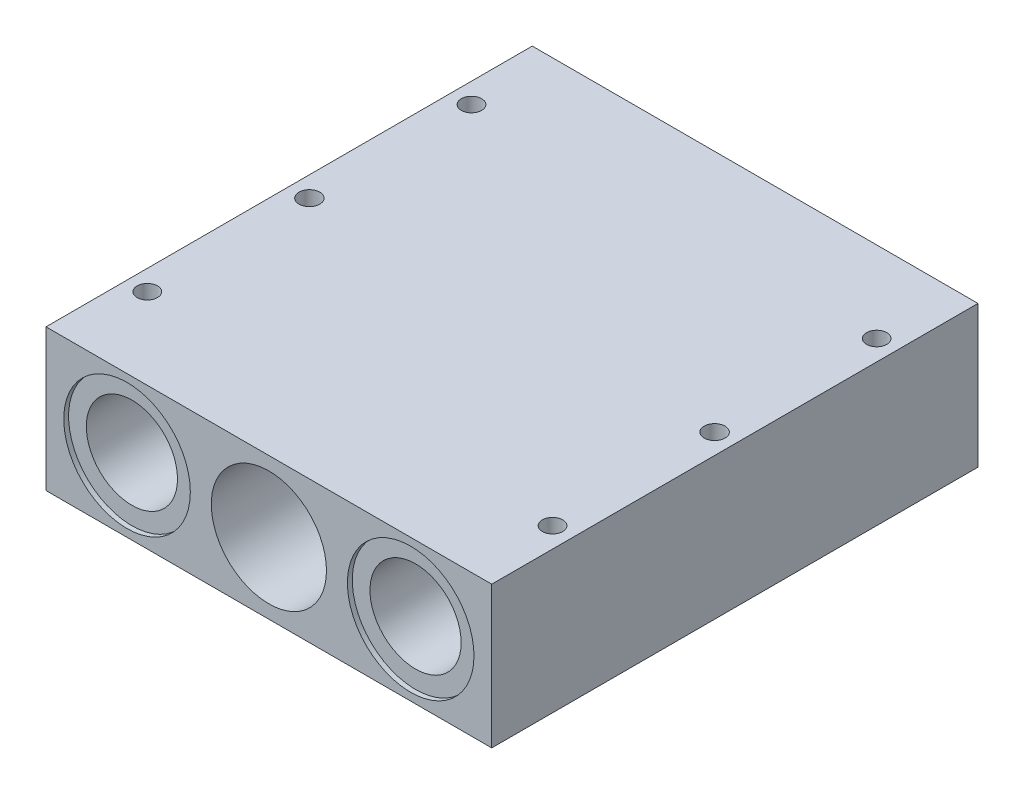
ISO-10303-21;
HEADER;
FILE_DESCRIPTION(('STEP AP214'),'2;1');
FILE_NAME('part.step','',(''),(''),'','','');
FILE_SCHEMA(('AUTOMOTIVE_DESIGN { 1 0 10303 214 1 1 1 1 }'));
ENDSEC;
DATA;
#1=APPLICATION_CONTEXT('core data for automotive mechanical design processes');
#2=APPLICATION_PROTOCOL_DEFINITION('international standard','automotive_design',2000,#1);
#3=PRODUCT_CONTEXT('',#1,'mechanical');
#4=PRODUCT('Part','Part','',(#3));
#5=PRODUCT_RELATED_PRODUCT_CATEGORY('part','',(#4));
#6=PRODUCT_DEFINITION_FORMATION('','',#4);
#7=PRODUCT_DEFINITION_CONTEXT('part definition',#1,'design');
#8=PRODUCT_DEFINITION('design','',#6,#7);
#9=PRODUCT_DEFINITION_SHAPE('','',#8);
#10=(LENGTH_UNIT() NAMED_UNIT(*) SI_UNIT(.MILLI.,.METRE.));
#11=(NAMED_UNIT(*) PLANE_ANGLE_UNIT() SI_UNIT($,.RADIAN.));
#12=(NAMED_UNIT(*) SI_UNIT($,.STERADIAN.) SOLID_ANGLE_UNIT());
#13=UNCERTAINTY_MEASURE_WITH_UNIT(LENGTH_MEASURE(1.E-05),#10,'distance_accuracy_value','');
#14=(GEOMETRIC_REPRESENTATION_CONTEXT(3) GLOBAL_UNCERTAINTY_ASSIGNED_CONTEXT((#13)) GLOBAL_UNIT_ASSIGNED_CONTEXT((#10,
#11,#12)) REPRESENTATION_CONTEXT('',''));
#15=CARTESIAN_POINT('',(0.,0.,0.));
#16=DIRECTION('',(0.,0.,1.));
#17=DIRECTION('',(1.,0.,0.));
#18=AXIS2_PLACEMENT_3D('',#15,#16,#17);
#19=CARTESIAN_POINT('',(44.45,0.,-76.2));
#20=DIRECTION('',(0.,0.,1.));
#21=DIRECTION('',(1.,0.,0.));
#22=AXIS2_PLACEMENT_3D('',#19,#20,#21);
#23=CYLINDRICAL_SURFACE('',#22,14.2875);
#24=CARTESIAN_POINT('',(44.45,0.,74.676));
#25=DIRECTION('',(0.,0.,1.));
#26=DIRECTION('',(1.,0.,0.));
#27=AXIS2_PLACEMENT_3D('',#24,#25,#26);
#28=CIRCLE('',#27,14.2875);
#29=CARTESIAN_POINT('',(58.7375,0.,74.676));
#30=VERTEX_POINT('',#29);
#31=EDGE_CURVE('E105',#30,#30,#28,.F.);
#32=CARTESIAN_POINT('',(44.45,0.,-74.676));
#33=DIRECTION('',(0.,0.,-1.));
#34=DIRECTION('',(-1.,0.,0.));
#35=AXIS2_PLACEMENT_3D('',#32,#33,#34);
#36=CIRCLE('',#35,14.2875);
#37=CARTESIAN_POINT('',(58.7375,0.,-74.676));
#38=VERTEX_POINT('',#37);
#39=EDGE_CURVE('E39',#38,#38,#36,.F.);
#40=CARTESIAN_POINT('',(58.7375,0.,74.676));
#41=CARTESIAN_POINT('',(58.7375,0.,73.12025));
#42=CARTESIAN_POINT('',(58.7375,0.,71.5645));
#43=CARTESIAN_POINT('',(58.7375,0.,68.453));
#44=CARTESIAN_POINT('',(58.7375,0.,66.89725));
#45=CARTESIAN_POINT('',(58.7375,0.,63.78575));
#46=CARTESIAN_POINT('',(58.7375,0.,62.23));
#47=CARTESIAN_POINT('',(58.7375,0.,59.1185));
#48=CARTESIAN_POINT('',(58.7375,0.,57.56275));
#49=CARTESIAN_POINT('',(58.7375,0.,54.45125));
#50=CARTESIAN_POINT('',(58.7375,0.,52.8955));
#51=CARTESIAN_POINT('',(58.7375,0.,49.784));
#52=CARTESIAN_POINT('',(58.7375,0.,48.22825));
#53=CARTESIAN_POINT('',(58.7375,0.,45.11675));
#54=CARTESIAN_POINT('',(58.7375,0.,43.561));
#55=CARTESIAN_POINT('',(58.7375,0.,40.4495));
#56=CARTESIAN_POINT('',(58.7375,0.,38.89375));
#57=CARTESIAN_POINT('',(58.7375,0.,35.78225));
#58=CARTESIAN_POINT('',(58.7375,0.,34.2265));
#59=CARTESIAN_POINT('',(58.7375,0.,31.115));
#60=CARTESIAN_POINT('',(58.7375,0.,29.55925));
#61=CARTESIAN_POINT('',(58.7375,0.,26.44775));
#62=CARTESIAN_POINT('',(58.7375,0.,24.892));
#63=CARTESIAN_POINT('',(58.7375,0.,21.7805));
#64=CARTESIAN_POINT('',(58.7375,0.,20.22475));
#65=CARTESIAN_POINT('',(58.7375,0.,17.11325));
#66=CARTESIAN_POINT('',(58.7375,0.,15.5575));
#67=CARTESIAN_POINT('',(58.7375,0.,12.446));
#68=CARTESIAN_POINT('',(58.7375,0.,10.89025));
#69=CARTESIAN_POINT('',(58.7375,0.,7.77874999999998));
#70=CARTESIAN_POINT('',(58.7375,0.,6.22299999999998));
#71=CARTESIAN_POINT('',(58.7375,0.,3.11149999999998));
#72=CARTESIAN_POINT('',(58.7375,0.,1.55574999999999));
#73=CARTESIAN_POINT('',(58.7375,0.,-1.55575000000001));
#74=CARTESIAN_POINT('',(58.7375,0.,-3.11150000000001));
#75=CARTESIAN_POINT('',(58.7375,0.,-6.22300000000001));
#76=CARTESIAN_POINT('',(58.7375,0.,-7.77875000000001));
#77=CARTESIAN_POINT('',(58.7375,0.,-10.89025));
#78=CARTESIAN_POINT('',(58.7375,0.,-12.446));
#79=CARTESIAN_POINT('',(58.7375,0.,-15.5575));
#80=CARTESIAN_POINT('',(58.7375,0.,-17.11325));
#81=CARTESIAN_POINT('',(58.7375,0.,-20.22475));
#82=CARTESIAN_POINT('',(58.7375,0.,-21.7805));
#83=CARTESIAN_POINT('',(58.7375,0.,-24.892));
#84=CARTESIAN_POINT('',(58.7375,0.,-26.44775));
#85=CARTESIAN_POINT('',(58.7375,0.,-29.55925));
#86=CARTESIAN_POINT('',(58.7375,0.,-31.115));
#87=CARTESIAN_POINT('',(58.7375,0.,-34.2265));
#88=CARTESIAN_POINT('',(58.7375,0.,-35.78225));
#89=CARTESIAN_POINT('',(58.7375,0.,-38.89375));
#90=CARTESIAN_POINT('',(58.7375,0.,-40.4495));
#91=CARTESIAN_POINT('',(58.7375,0.,-43.561));
#92=CARTESIAN_POINT('',(58.7375,0.,-45.11675));
#93=CARTESIAN_POINT('',(58.7375,0.,-48.22825));
#94=CARTESIAN_POINT('',(58.7375,0.,-49.784));
#95=CARTESIAN_POINT('',(58.7375,0.,-52.8955));
#96=CARTESIAN_POINT('',(58.7375,0.,-54.45125));
#97=CARTESIAN_POINT('',(58.7375,0.,-57.56275));
#98=CARTESIAN_POINT('',(58.7375,0.,-59.1185));
#99=CARTESIAN_POINT('',(58.7375,0.,-62.23));
#100=CARTESIAN_POINT('',(58.7375,0.,-63.78575));
#101=CARTESIAN_POINT('',(58.7375,0.,-66.89725));
#102=CARTESIAN_POINT('',(58.7375,0.,-68.453));
#103=CARTESIAN_POINT('',(58.7375,0.,-71.5645));
#104=CARTESIAN_POINT('',(58.7375,0.,-73.12025));
#105=CARTESIAN_POINT('',(58.7375,0.,-74.676));
#106=B_SPLINE_CURVE_WITH_KNOTS('',3,(#40,#41,#42,#43,#44,#45,#46,#47,#48,#49,#50,#51,#52,#53,
#54,#55,#56,#57,#58,#59,#60,#61,#62,#63,#64,#65,#66,#67,#68,#69,#70,#71,#72,#73,#74,#75,#76,#77,
#78,#79,#80,#81,#82,#83,#84,#85,#86,#87,#88,#89,#90,#91,#92,#93,#94,#95,#96,#97,#98,#99,#100,
#101,#102,#103,#104,#105),.UNSPECIFIED.,.F.,.F.,(4,2,2,2,2,2,2,2,2,2,2,2,2,2,2,2,2,2,2,2,2,2,2,
2,2,2,2,2,2,2,2,2,4),(0.,4.66725000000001,9.33449999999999,14.00175,18.669,23.33625,28.0035,
32.67075,37.338,42.00525,46.6725,51.33975,56.007,60.67425,65.3415,70.00875,74.676,79.34325,
84.0105,88.67775,93.345,98.01225,102.6795,107.34675,112.014,116.68125,121.3485,126.01575,
130.683,135.35025,140.0175,144.68475,149.352),.UNSPECIFIED.);
#107=EDGE_CURVE('BSEAM35',#30,#38,#106,.T.);
#108=ORIENTED_EDGE('',*,*,#31,.F.);
#109=ORIENTED_EDGE('',*,*,#39,.F.);
#110=ORIENTED_EDGE('',*,*,#107,.T.);
#111=ORIENTED_EDGE('',*,*,#107,.F.);
#112=EDGE_LOOP('',(#108,#110,#109,#111));
#113=FACE_BOUND('',#112,.T.);
#114=ADVANCED_FACE('F35',(#113),#23,.F.);
#115=CARTESIAN_POINT('',(-44.45,0.,-76.2));
#116=DIRECTION('',(0.,0.,1.));
#117=DIRECTION('',(1.,0.,0.));
#118=AXIS2_PLACEMENT_3D('',#115,#116,#117);
#119=CYLINDRICAL_SURFACE('',#118,14.2875);
#120=CARTESIAN_POINT('',(-44.45,0.,74.676));
#121=DIRECTION('',(0.,0.,1.));
#122=DIRECTION('',(1.,0.,0.));
#123=AXIS2_PLACEMENT_3D('',#120,#121,#122);
#124=CIRCLE('',#123,14.2875);
#125=CARTESIAN_POINT('',(-30.1625,0.,74.676));
#126=VERTEX_POINT('',#125);
#127=EDGE_CURVE('E114',#126,#126,#124,.F.);
#128=CARTESIAN_POINT('',(-44.45,0.,-74.676));
#129=DIRECTION('',(0.,0.,-1.));
#130=DIRECTION('',(-1.,0.,0.));
#131=AXIS2_PLACEMENT_3D('',#128,#129,#130);
#132=CIRCLE('',#131,14.2875);
#133=CARTESIAN_POINT('',(-30.1625,0.,-74.676));
#134=VERTEX_POINT('',#133);
#135=EDGE_CURVE('E118',#134,#134,#132,.F.);
#136=CARTESIAN_POINT('',(-30.1625,0.,74.676));
#137=CARTESIAN_POINT('',(-30.1625,0.,73.12025));
#138=CARTESIAN_POINT('',(-30.1625,0.,71.5645));
#139=CARTESIAN_POINT('',(-30.1625,0.,68.453));
#140=CARTESIAN_POINT('',(-30.1625,0.,66.89725));
#141=CARTESIAN_POINT('',(-30.1625,0.,63.78575));
#142=CARTESIAN_POINT('',(-30.1625,0.,62.23));
#143=CARTESIAN_POINT('',(-30.1625,0.,59.1185));
#144=CARTESIAN_POINT('',(-30.1625,0.,57.56275));
#145=CARTESIAN_POINT('',(-30.1625,0.,54.45125));
#146=CARTESIAN_POINT('',(-30.1625,0.,52.8955));
#147=CARTESIAN_POINT('',(-30.1625,0.,49.784));
#148=CARTESIAN_POINT('',(-30.1625,0.,48.22825));
#149=CARTESIAN_POINT('',(-30.1625,0.,45.11675));
#150=CARTESIAN_POINT('',(-30.1625,0.,43.561));
#151=CARTESIAN_POINT('',(-30.1625,0.,40.4495));
#152=CARTESIAN_POINT('',(-30.1625,0.,38.89375));
#153=CARTESIAN_POINT('',(-30.1625,0.,35.78225));
#154=CARTESIAN_POINT('',(-30.1625,0.,34.2265));
#155=CARTESIAN_POINT('',(-30.1625,0.,31.115));
#156=CARTESIAN_POINT('',(-30.1625,0.,29.55925));
#157=CARTESIAN_POINT('',(-30.1625,0.,26.44775));
#158=CARTESIAN_POINT('',(-30.1625,0.,24.892));
#159=CARTESIAN_POINT('',(-30.1625,0.,21.7805));
#160=CARTESIAN_POINT('',(-30.1625,0.,20.22475));
#161=CARTESIAN_POINT('',(-30.1625,0.,17.11325));
#162=CARTESIAN_POINT('',(-30.1625,0.,15.5575));
#163=CARTESIAN_POINT('',(-30.1625,0.,12.446));
#164=CARTESIAN_POINT('',(-30.1625,0.,10.89025));
#165=CARTESIAN_POINT('',(-30.1625,0.,7.77874999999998));
#166=CARTESIAN_POINT('',(-30.1625,0.,6.22299999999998));
#167=CARTESIAN_POINT('',(-30.1625,0.,3.11149999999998));
#168=CARTESIAN_POINT('',(-30.1625,0.,1.55574999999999));
#169=CARTESIAN_POINT('',(-30.1625,0.,-1.55575000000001));
#170=CARTESIAN_POINT('',(-30.1625,0.,-3.11150000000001));
#171=CARTESIAN_POINT('',(-30.1625,0.,-6.22300000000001));
#172=CARTESIAN_POINT('',(-30.1625,0.,-7.77875000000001));
#173=CARTESIAN_POINT('',(-30.1625,0.,-10.89025));
#174=CARTESIAN_POINT('',(-30.1625,0.,-12.446));
#175=CARTESIAN_POINT('',(-30.1625,0.,-15.5575));
#176=CARTESIAN_POINT('',(-30.1625,0.,-17.11325));
#177=CARTESIAN_POINT('',(-30.1625,0.,-20.22475));
#178=CARTESIAN_POINT('',(-30.1625,0.,-21.7805));
#179=CARTESIAN_POINT('',(-30.1625,0.,-24.892));
#180=CARTESIAN_POINT('',(-30.1625,0.,-26.44775));
#181=CARTESIAN_POINT('',(-30.1625,0.,-29.55925));
#182=CARTESIAN_POINT('',(-30.1625,0.,-31.115));
#183=CARTESIAN_POINT('',(-30.1625,0.,-34.2265));
#184=CARTESIAN_POINT('',(-30.1625,0.,-35.78225));
#185=CARTESIAN_POINT('',(-30.1625,0.,-38.89375));
#186=CARTESIAN_POINT('',(-30.1625,0.,-40.4495));
#187=CARTESIAN_POINT('',(-30.1625,0.,-43.561));
#188=CARTESIAN_POINT('',(-30.1625,0.,-45.11675));
#189=CARTESIAN_POINT('',(-30.1625,0.,-48.22825));
#190=CARTESIAN_POINT('',(-30.1625,0.,-49.784));
#191=CARTESIAN_POINT('',(-30.1625,0.,-52.8955));
#192=CARTESIAN_POINT('',(-30.1625,0.,-54.45125));
#193=CARTESIAN_POINT('',(-30.1625,0.,-57.56275));
#194=CARTESIAN_POINT('',(-30.1625,0.,-59.1185));
#195=CARTESIAN_POINT('',(-30.1625,0.,-62.23));
#196=CARTESIAN_POINT('',(-30.1625,0.,-63.78575));
#197=CARTESIAN_POINT('',(-30.1625,0.,-66.89725));
#198=CARTESIAN_POINT('',(-30.1625,0.,-68.453));
#199=CARTESIAN_POINT('',(-30.1625,0.,-71.5645));
#200=CARTESIAN_POINT('',(-30.1625,0.,-73.12025));
#201=CARTESIAN_POINT('',(-30.1625,0.,-74.676));
#202=B_SPLINE_CURVE_WITH_KNOTS('',3,(#136,#137,#138,#139,#140,#141,#142,#143,#144,#145,#146,
#147,#148,#149,#150,#151,#152,#153,#154,#155,#156,#157,#158,#159,#160,#161,#162,#163,#164,#165,
#166,#167,#168,#169,#170,#171,#172,#173,#174,#175,#176,#177,#178,#179,#180,#181,#182,#183,#184,
#185,#186,#187,#188,#189,#190,#191,#192,#193,#194,#195,#196,#197,#198,#199,#200,#201),
.UNSPECIFIED.,.F.,.F.,(4,2,2,2,2,2,2,2,2,2,2,2,2,2,2,2,2,2,2,2,2,2,2,2,2,2,2,2,2,2,2,2,4),(0.,
4.66725000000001,9.33449999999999,14.00175,18.669,23.33625,28.0035,32.67075,37.338,42.00525,
46.6725,51.33975,56.007,60.67425,65.3415,70.00875,74.676,79.34325,84.0105,88.67775,93.345,
98.01225,102.6795,107.34675,112.014,116.68125,121.3485,126.01575,130.683,135.35025,140.0175,
144.68475,149.352),.UNSPECIFIED.);
#203=EDGE_CURVE('BSEAM154',#126,#134,#202,.T.);
#204=ORIENTED_EDGE('',*,*,#127,.F.);
#205=ORIENTED_EDGE('',*,*,#135,.F.);
#206=ORIENTED_EDGE('',*,*,#203,.T.);
#207=ORIENTED_EDGE('',*,*,#203,.F.);
#208=EDGE_LOOP('',(#204,#206,#205,#207));
#209=FACE_BOUND('',#208,.T.);
#210=ADVANCED_FACE('F154',(#209),#119,.F.);
#211=CARTESIAN_POINT('',(-69.85,22.225,-76.2));
#212=DIRECTION('',(1.,0.,0.));
#213=DIRECTION('',(0.,0.,-1.));
#214=AXIS2_PLACEMENT_3D('',#211,#212,#213);
#215=PLANE('',#214);
#216=DIRECTION('',(0.,0.,1.));
#217=VECTOR('',#216,1.);
#218=CARTESIAN_POINT('',(-69.85,-22.225,-76.2));
#219=LINE('',#218,#217);
#220=CARTESIAN_POINT('',(-69.85,-22.225,-76.2));
#221=VERTEX_POINT('',#220);
#222=CARTESIAN_POINT('',(-69.85,-22.225,76.2));
#223=VERTEX_POINT('',#222);
#224=EDGE_CURVE('E102',#221,#223,#219,.T.);
#225=ORIENTED_EDGE('',*,*,#224,.T.);
#226=DIRECTION('',(0.,-1.,0.));
#227=VECTOR('',#226,1.);
#228=CARTESIAN_POINT('',(-69.85,22.225,76.2));
#229=LINE('',#228,#227);
#230=CARTESIAN_POINT('',(-69.85,22.225,76.2));
#231=VERTEX_POINT('',#230);
#232=EDGE_CURVE('E11',#231,#223,#229,.T.);
#233=ORIENTED_EDGE('',*,*,#232,.F.);
#234=DIRECTION('',(0.,0.,1.));
#235=VECTOR('',#234,1.);
#236=CARTESIAN_POINT('',(-69.85,22.225,-76.2));
#237=LINE('',#236,#235);
#238=CARTESIAN_POINT('',(-69.85,22.225,-76.2));
#239=VERTEX_POINT('',#238);
#240=EDGE_CURVE('E89',#239,#231,#237,.T.);
#241=ORIENTED_EDGE('',*,*,#240,.F.);
#242=DIRECTION('',(0.,-1.,0.));
#243=VECTOR('',#242,1.);
#244=CARTESIAN_POINT('',(-69.85,22.225,-76.2));
#245=LINE('',#244,#243);
#246=EDGE_CURVE('E98',#239,#221,#245,.T.);
#247=ORIENTED_EDGE('',*,*,#246,.T.);
#248=EDGE_LOOP('',(#225,#233,#241,#247));
#249=FACE_BOUND('',#248,.T.);
#250=ADVANCED_FACE('F37',(#249),#215,.F.);
#251=CARTESIAN_POINT('',(-69.85,22.225,76.2));
#252=DIRECTION('',(0.,0.,-1.));
#253=DIRECTION('',(-1.,0.,0.));
#254=AXIS2_PLACEMENT_3D('',#251,#252,#253);
#255=PLANE('',#254);
#256=CARTESIAN_POINT('',(0.,0.,76.2));
#257=DIRECTION('',(0.,0.,1.));
#258=DIRECTION('',(1.,0.,0.));
#259=AXIS2_PLACEMENT_3D('',#256,#257,#258);
#260=CIRCLE('',#259,18.0467);
#261=CARTESIAN_POINT('',(18.0467,0.,76.2));
#262=VERTEX_POINT('',#261);
#263=EDGE_CURVE('E440',#262,#262,#260,.T.);
#264=ORIENTED_EDGE('',*,*,#263,.F.);
#265=EDGE_LOOP('',(#264));
#266=FACE_BOUND('',#265,.T.);
#267=CARTESIAN_POINT('',(-44.45,0.,76.2));
#268=DIRECTION('',(0.,0.,1.));
#269=DIRECTION('',(1.,0.,0.));
#270=AXIS2_PLACEMENT_3D('',#267,#268,#269);
#271=CIRCLE('',#270,19.8374);
#272=CARTESIAN_POINT('',(-24.6126,0.,76.2));
#273=VERTEX_POINT('',#272);
#274=EDGE_CURVE('E120',#273,#273,#271,.T.);
#275=ORIENTED_EDGE('',*,*,#274,.F.);
#276=EDGE_LOOP('',(#275));
#277=FACE_BOUND('',#276,.T.);
#278=CARTESIAN_POINT('',(44.45,0.,76.2));
#279=DIRECTION('',(0.,0.,1.));
#280=DIRECTION('',(1.,0.,0.));
#281=AXIS2_PLACEMENT_3D('',#278,#279,#280);
#282=CIRCLE('',#281,19.8374);
#283=CARTESIAN_POINT('',(64.2874,0.,76.2));
#284=VERTEX_POINT('',#283);
#285=EDGE_CURVE('E116',#284,#284,#282,.T.);
#286=ORIENTED_EDGE('',*,*,#285,.F.);
#287=EDGE_LOOP('',(#286));
#288=FACE_BOUND('',#287,.T.);
#289=DIRECTION('',(1.,0.,0.));
#290=VECTOR('',#289,1.);
#291=CARTESIAN_POINT('',(-69.85,-22.225,76.2));
#292=LINE('',#291,#290);
#293=CARTESIAN_POINT('',(69.85,-22.225,76.2));
#294=VERTEX_POINT('',#293);
#295=EDGE_CURVE('E93',#223,#294,#292,.T.);
#296=ORIENTED_EDGE('',*,*,#295,.T.);
#297=DIRECTION('',(0.,-1.,0.));
#298=VECTOR('',#297,1.);
#299=CARTESIAN_POINT('',(69.85,22.225,76.2));
#300=LINE('',#299,#298);
#301=CARTESIAN_POINT('',(69.85,22.225,76.2));
#302=VERTEX_POINT('',#301);
#303=EDGE_CURVE('E45',#302,#294,#300,.T.);
#304=ORIENTED_EDGE('',*,*,#303,.F.);
#305=DIRECTION('',(1.,0.,0.));
#306=VECTOR('',#305,1.);
#307=CARTESIAN_POINT('',(-69.85,22.225,76.2));
#308=LINE('',#307,#306);
#309=EDGE_CURVE('E84',#231,#302,#308,.T.);
#310=ORIENTED_EDGE('',*,*,#309,.F.);
#311=ORIENTED_EDGE('',*,*,#232,.T.);
#312=EDGE_LOOP('',(#296,#304,#310,#311));
#313=FACE_BOUND('',#312,.T.);
#314=ADVANCED_FACE('F92',(#266,#277,#288,#313),#255,.F.);
#315=CARTESIAN_POINT('',(69.85,22.225,-76.2));
#316=DIRECTION('',(-1.,0.,0.));
#317=DIRECTION('',(0.,0.,1.));
#318=AXIS2_PLACEMENT_3D('',#315,#316,#317);
#319=PLANE('',#318);
#320=DIRECTION('',(0.,0.,-1.));
#321=VECTOR('',#320,1.);
#322=CARTESIAN_POINT('',(69.85,-22.225,-76.2));
#323=LINE('',#322,#321);
#324=CARTESIAN_POINT('',(69.85,-22.225,-76.2));
#325=VERTEX_POINT('',#324);
#326=EDGE_CURVE('E71',#294,#325,#323,.T.);
#327=ORIENTED_EDGE('',*,*,#326,.T.);
#328=DIRECTION('',(0.,-1.,0.));
#329=VECTOR('',#328,1.);
#330=CARTESIAN_POINT('',(69.85,22.225,-76.2));
#331=LINE('',#330,#329);
#332=CARTESIAN_POINT('',(69.85,22.225,-76.2));
#333=VERTEX_POINT('',#332);
#334=EDGE_CURVE('E94',#333,#325,#331,.T.);
#335=ORIENTED_EDGE('',*,*,#334,.F.);
#336=DIRECTION('',(0.,0.,-1.));
#337=VECTOR('',#336,1.);
#338=CARTESIAN_POINT('',(69.85,22.225,-76.2));
#339=LINE('',#338,#337);
#340=EDGE_CURVE('E87',#302,#333,#339,.T.);
#341=ORIENTED_EDGE('',*,*,#340,.F.);
#342=ORIENTED_EDGE('',*,*,#303,.T.);
#343=EDGE_LOOP('',(#327,#335,#341,#342));
#344=FACE_BOUND('',#343,.T.);
#345=ADVANCED_FACE('F96',(#344),#319,.F.);
#346=CARTESIAN_POINT('',(-69.85,22.225,-76.2));
#347=DIRECTION('',(0.,0.,1.));
#348=DIRECTION('',(1.,0.,0.));
#349=AXIS2_PLACEMENT_3D('',#346,#347,#348);
#350=PLANE('',#349);
#351=CARTESIAN_POINT('',(0.,0.,-76.2));
#352=DIRECTION('',(0.,0.,1.));
#353=DIRECTION('',(1.,0.,0.));
#354=AXIS2_PLACEMENT_3D('',#351,#352,#353);
#355=CIRCLE('',#354,18.0467);
#356=CARTESIAN_POINT('',(18.0467,0.,-76.2));
#357=VERTEX_POINT('',#356);
#358=EDGE_CURVE('E185',#357,#357,#355,.T.);
#359=ORIENTED_EDGE('',*,*,#358,.T.);
#360=EDGE_LOOP('',(#359));
#361=FACE_BOUND('',#360,.T.);
#362=CARTESIAN_POINT('',(44.45,0.,-76.2));
#363=DIRECTION('',(0.,0.,-1.));
#364=DIRECTION('',(-1.,0.,0.));
#365=AXIS2_PLACEMENT_3D('',#362,#363,#364);
#366=CIRCLE('',#365,19.8374);
#367=CARTESIAN_POINT('',(24.6126,0.,-76.2));
#368=VERTEX_POINT('',#367);
#369=EDGE_CURVE('E134',#368,#368,#366,.T.);
#370=ORIENTED_EDGE('',*,*,#369,.F.);
#371=EDGE_LOOP('',(#370));
#372=FACE_BOUND('',#371,.T.);
#373=CARTESIAN_POINT('',(-44.45,0.,-76.2));
#374=DIRECTION('',(0.,0.,-1.));
#375=DIRECTION('',(-1.,0.,0.));
#376=AXIS2_PLACEMENT_3D('',#373,#374,#375);
#377=CIRCLE('',#376,19.8374);
#378=CARTESIAN_POINT('',(-64.2874,0.,-76.2));
#379=VERTEX_POINT('',#378);
#380=EDGE_CURVE('E127',#379,#379,#377,.T.);
#381=ORIENTED_EDGE('',*,*,#380,.F.);
#382=EDGE_LOOP('',(#381));
#383=FACE_BOUND('',#382,.T.);
#384=DIRECTION('',(-1.,0.,0.));
#385=VECTOR('',#384,1.);
#386=CARTESIAN_POINT('',(-69.85,-22.225,-76.2));
#387=LINE('',#386,#385);
#388=EDGE_CURVE('E77',#325,#221,#387,.T.);
#389=ORIENTED_EDGE('',*,*,#388,.T.);
#390=ORIENTED_EDGE('',*,*,#246,.F.);
#391=DIRECTION('',(-1.,0.,0.));
#392=VECTOR('',#391,1.);
#393=CARTESIAN_POINT('',(-69.85,22.225,-76.2));
#394=LINE('',#393,#392);
#395=EDGE_CURVE('E54',#333,#239,#394,.T.);
#396=ORIENTED_EDGE('',*,*,#395,.F.);
#397=ORIENTED_EDGE('',*,*,#334,.T.);
#398=EDGE_LOOP('',(#389,#390,#396,#397));
#399=FACE_BOUND('',#398,.T.);
#400=ADVANCED_FACE('F152',(#361,#372,#383,#399),#350,.F.);
#401=CARTESIAN_POINT('',(-69.85,22.225,76.2));
#402=DIRECTION('',(0.,1.,0.));
#403=DIRECTION('',(0.,0.,1.));
#404=AXIS2_PLACEMENT_3D('',#401,#402,#403);
#405=PLANE('',#404);
#406=CARTESIAN_POINT('',(-63.5,22.225,50.8));
#407=DIRECTION('',(0.,1.,0.));
#408=DIRECTION('',(0.,0.,1.));
#409=AXIS2_PLACEMENT_3D('',#406,#407,#408);
#410=CIRCLE('',#409,3.18770000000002);
#411=CARTESIAN_POINT('',(-63.5,22.225,53.9877));
#412=VERTEX_POINT('',#411);
#413=EDGE_CURVE('E406',#412,#412,#410,.T.);
#414=ORIENTED_EDGE('',*,*,#413,.F.);
#415=EDGE_LOOP('',(#414));
#416=FACE_BOUND('',#415,.T.);
#417=CARTESIAN_POINT('',(-63.5,22.225,-50.8));
#418=DIRECTION('',(0.,1.,0.));
#419=DIRECTION('',(0.,0.,1.));
#420=AXIS2_PLACEMENT_3D('',#417,#418,#419);
#421=CIRCLE('',#420,3.18770000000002);
#422=CARTESIAN_POINT('',(-63.5,22.225,-47.6123));
#423=VERTEX_POINT('',#422);
#424=EDGE_CURVE('E408',#423,#423,#421,.T.);
#425=ORIENTED_EDGE('',*,*,#424,.F.);
#426=EDGE_LOOP('',(#425));
#427=FACE_BOUND('',#426,.T.);
#428=CARTESIAN_POINT('',(63.5,22.225,-50.8));
#429=DIRECTION('',(0.,1.,0.));
#430=DIRECTION('',(0.,0.,1.));
#431=AXIS2_PLACEMENT_3D('',#428,#429,#430);
#432=CIRCLE('',#431,3.18770000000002);
#433=CARTESIAN_POINT('',(63.5,22.225,-47.6123));
#434=VERTEX_POINT('',#433);
#435=EDGE_CURVE('E416',#434,#434,#432,.T.);
#436=ORIENTED_EDGE('',*,*,#435,.F.);
#437=EDGE_LOOP('',(#436));
#438=FACE_BOUND('',#437,.T.);
#439=CARTESIAN_POINT('',(63.5,22.225,50.8));
#440=DIRECTION('',(0.,1.,0.));
#441=DIRECTION('',(0.,0.,1.));
#442=AXIS2_PLACEMENT_3D('',#439,#440,#441);
#443=CIRCLE('',#442,3.18770000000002);
#444=CARTESIAN_POINT('',(63.5,22.225,53.9877));
#445=VERTEX_POINT('',#444);
#446=EDGE_CURVE('E422',#445,#445,#443,.T.);
#447=ORIENTED_EDGE('',*,*,#446,.F.);
#448=EDGE_LOOP('',(#447));
#449=FACE_BOUND('',#448,.T.);
#450=CARTESIAN_POINT('',(-63.5,22.225,0.));
#451=DIRECTION('',(0.,1.,0.));
#452=DIRECTION('',(0.,0.,1.));
#453=AXIS2_PLACEMENT_3D('',#450,#451,#452);
#454=CIRCLE('',#453,3.26389999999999);
#455=CARTESIAN_POINT('',(-63.5,22.225,3.26389999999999));
#456=VERTEX_POINT('',#455);
#457=EDGE_CURVE('E431',#456,#456,#454,.T.);
#458=ORIENTED_EDGE('',*,*,#457,.F.);
#459=EDGE_LOOP('',(#458));
#460=FACE_BOUND('',#459,.T.);
#461=CARTESIAN_POINT('',(63.5,22.225,0.));
#462=DIRECTION('',(0.,1.,0.));
#463=DIRECTION('',(0.,0.,1.));
#464=AXIS2_PLACEMENT_3D('',#461,#462,#463);
#465=CIRCLE('',#464,3.26389999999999);
#466=CARTESIAN_POINT('',(63.5,22.225,3.26389999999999));
#467=VERTEX_POINT('',#466);
#468=EDGE_CURVE('E437',#467,#467,#465,.T.);
#469=ORIENTED_EDGE('',*,*,#468,.F.);
#470=EDGE_LOOP('',(#469));
#471=FACE_BOUND('',#470,.T.);
#472=ORIENTED_EDGE('',*,*,#240,.T.);
#473=ORIENTED_EDGE('',*,*,#309,.T.);
#474=ORIENTED_EDGE('',*,*,#340,.T.);
#475=ORIENTED_EDGE('',*,*,#395,.T.);
#476=EDGE_LOOP('',(#472,#473,#474,#475));
#477=FACE_BOUND('',#476,.T.);
#478=ADVANCED_FACE('F85',(#416,#427,#438,#449,#460,#471,#477),#405,.T.);
#479=CARTESIAN_POINT('',(-69.85,-22.225,76.2));
#480=DIRECTION('',(0.,1.,0.));
#481=DIRECTION('',(0.,0.,1.));
#482=AXIS2_PLACEMENT_3D('',#479,#480,#481);
#483=PLANE('',#482);
#484=CARTESIAN_POINT('',(-63.5,-22.225,0.));
#485=DIRECTION('',(0.,1.,0.));
#486=DIRECTION('',(0.,0.,1.));
#487=AXIS2_PLACEMENT_3D('',#484,#485,#486);
#488=CIRCLE('',#487,3.26389999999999);
#489=CARTESIAN_POINT('',(-63.5,-22.225,3.26389999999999));
#490=VERTEX_POINT('',#489);
#491=EDGE_CURVE('E428',#490,#490,#488,.T.);
#492=ORIENTED_EDGE('',*,*,#491,.T.);
#493=EDGE_LOOP('',(#492));
#494=FACE_BOUND('',#493,.T.);
#495=CARTESIAN_POINT('',(63.5,-22.225,0.));
#496=DIRECTION('',(0.,1.,0.));
#497=DIRECTION('',(0.,0.,1.));
#498=AXIS2_PLACEMENT_3D('',#495,#496,#497);
#499=CIRCLE('',#498,3.26389999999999);
#500=CARTESIAN_POINT('',(63.5,-22.225,3.26389999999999));
#501=VERTEX_POINT('',#500);
#502=EDGE_CURVE('E434',#501,#501,#499,.T.);
#503=ORIENTED_EDGE('',*,*,#502,.T.);
#504=EDGE_LOOP('',(#503));
#505=FACE_BOUND('',#504,.T.);
#506=ORIENTED_EDGE('',*,*,#224,.F.);
#507=ORIENTED_EDGE('',*,*,#388,.F.);
#508=ORIENTED_EDGE('',*,*,#326,.F.);
#509=ORIENTED_EDGE('',*,*,#295,.F.);
#510=EDGE_LOOP('',(#506,#507,#508,#509));
#511=FACE_BOUND('',#510,.T.);
#512=ADVANCED_FACE('F172',(#494,#505,#511),#483,.F.);
#513=CARTESIAN_POINT('',(44.45,0.,74.676));
#514=DIRECTION('',(0.,0.,1.));
#515=DIRECTION('',(1.,0.,0.));
#516=AXIS2_PLACEMENT_3D('',#513,#514,#515);
#517=PLANE('',#516);
#518=CARTESIAN_POINT('',(44.45,0.,74.676));
#519=DIRECTION('',(0.,0.,1.));
#520=DIRECTION('',(1.,0.,0.));
#521=AXIS2_PLACEMENT_3D('',#518,#519,#520);
#522=CIRCLE('',#521,19.8374);
#523=CARTESIAN_POINT('',(64.2874,0.,74.676));
#524=VERTEX_POINT('',#523);
#525=EDGE_CURVE('E113',#524,#524,#522,.T.);
#526=ORIENTED_EDGE('',*,*,#525,.T.);
#527=EDGE_LOOP('',(#526));
#528=FACE_BOUND('',#527,.T.);
#529=ORIENTED_EDGE('',*,*,#31,.T.);
#530=EDGE_LOOP('',(#529));
#531=FACE_BOUND('',#530,.T.);
#532=ADVANCED_FACE('F176',(#528,#531),#517,.T.);
#533=CARTESIAN_POINT('',(44.45,0.,74.676));
#534=DIRECTION('',(0.,0.,1.));
#535=DIRECTION('',(1.,0.,0.));
#536=AXIS2_PLACEMENT_3D('',#533,#534,#535);
#537=CYLINDRICAL_SURFACE('',#536,19.8374);
#538=CARTESIAN_POINT('',(64.2874,0.,74.676));
#539=CARTESIAN_POINT('',(64.2874,0.,74.691875));
#540=CARTESIAN_POINT('',(64.2874,0.,74.70775));
#541=CARTESIAN_POINT('',(64.2874,0.,74.7395));
#542=CARTESIAN_POINT('',(64.2874,0.,74.755375));
#543=CARTESIAN_POINT('',(64.2874,0.,74.787125));
#544=CARTESIAN_POINT('',(64.2874,0.,74.803));
#545=CARTESIAN_POINT('',(64.2874,0.,74.83475));
#546=CARTESIAN_POINT('',(64.2874,0.,74.850625));
#547=CARTESIAN_POINT('',(64.2874,0.,74.882375));
#548=CARTESIAN_POINT('',(64.2874,0.,74.89825));
#549=CARTESIAN_POINT('',(64.2874,0.,74.93));
#550=CARTESIAN_POINT('',(64.2874,0.,74.945875));
#551=CARTESIAN_POINT('',(64.2874,0.,74.977625));
#552=CARTESIAN_POINT('',(64.2874,0.,74.9935));
#553=CARTESIAN_POINT('',(64.2874,0.,75.02525));
#554=CARTESIAN_POINT('',(64.2874,0.,75.041125));
#555=CARTESIAN_POINT('',(64.2874,0.,75.072875));
#556=CARTESIAN_POINT('',(64.2874,0.,75.08875));
#557=CARTESIAN_POINT('',(64.2874,0.,75.1205));
#558=CARTESIAN_POINT('',(64.2874,0.,75.136375));
#559=CARTESIAN_POINT('',(64.2874,0.,75.168125));
#560=CARTESIAN_POINT('',(64.2874,0.,75.184));
#561=CARTESIAN_POINT('',(64.2874,0.,75.21575));
#562=CARTESIAN_POINT('',(64.2874,0.,75.231625));
#563=CARTESIAN_POINT('',(64.2874,0.,75.263375));
#564=CARTESIAN_POINT('',(64.2874,0.,75.27925));
#565=CARTESIAN_POINT('',(64.2874,0.,75.311));
#566=CARTESIAN_POINT('',(64.2874,0.,75.326875));
#567=CARTESIAN_POINT('',(64.2874,0.,75.358625));
#568=CARTESIAN_POINT('',(64.2874,0.,75.3745));
#569=CARTESIAN_POINT('',(64.2874,0.,75.40625));
#570=CARTESIAN_POINT('',(64.2874,0.,75.422125));
#571=CARTESIAN_POINT('',(64.2874,0.,75.453875));
#572=CARTESIAN_POINT('',(64.2874,0.,75.46975));
#573=CARTESIAN_POINT('',(64.2874,0.,75.5015));
#574=CARTESIAN_POINT('',(64.2874,0.,75.517375));
#575=CARTESIAN_POINT('',(64.2874,0.,75.549125));
#576=CARTESIAN_POINT('',(64.2874,0.,75.565));
#577=CARTESIAN_POINT('',(64.2874,0.,75.59675));
#578=CARTESIAN_POINT('',(64.2874,0.,75.612625));
#579=CARTESIAN_POINT('',(64.2874,0.,75.644375));
#580=CARTESIAN_POINT('',(64.2874,0.,75.66025));
#581=CARTESIAN_POINT('',(64.2874,0.,75.692));
#582=CARTESIAN_POINT('',(64.2874,0.,75.707875));
#583=CARTESIAN_POINT('',(64.2874,0.,75.739625));
#584=CARTESIAN_POINT('',(64.2874,0.,75.7555));
#585=CARTESIAN_POINT('',(64.2874,0.,75.78725));
#586=CARTESIAN_POINT('',(64.2874,0.,75.803125));
#587=CARTESIAN_POINT('',(64.2874,0.,75.834875));
#588=CARTESIAN_POINT('',(64.2874,0.,75.85075));
#589=CARTESIAN_POINT('',(64.2874,0.,75.8825));
#590=CARTESIAN_POINT('',(64.2874,0.,75.898375));
#591=CARTESIAN_POINT('',(64.2874,0.,75.930125));
#592=CARTESIAN_POINT('',(64.2874,0.,75.946));
#593=CARTESIAN_POINT('',(64.2874,0.,75.97775));
#594=CARTESIAN_POINT('',(64.2874,0.,75.993625));
#595=CARTESIAN_POINT('',(64.2874,0.,76.025375));
#596=CARTESIAN_POINT('',(64.2874,0.,76.04125));
#597=CARTESIAN_POINT('',(64.2874,0.,76.073));
#598=CARTESIAN_POINT('',(64.2874,0.,76.088875));
#599=CARTESIAN_POINT('',(64.2874,0.,76.120625));
#600=CARTESIAN_POINT('',(64.2874,0.,76.1365));
#601=CARTESIAN_POINT('',(64.2874,0.,76.16825));
#602=CARTESIAN_POINT('',(64.2874,0.,76.184125));
#603=CARTESIAN_POINT('',(64.2874,0.,76.2));
#604=B_SPLINE_CURVE_WITH_KNOTS('',3,(#538,#539,#540,#541,#542,#543,#544,#545,#546,#547,#548,
#549,#550,#551,#552,#553,#554,#555,#556,#557,#558,#559,#560,#561,#562,#563,#564,#565,#566,#567,
#568,#569,#570,#571,#572,#573,#574,#575,#576,#577,#578,#579,#580,#581,#582,#583,#584,#585,#586,
#587,#588,#589,#590,#591,#592,#593,#594,#595,#596,#597,#598,#599,#600,#601,#602,#603),
.UNSPECIFIED.,.F.,.F.,(4,2,2,2,2,2,2,2,2,2,2,2,2,2,2,2,2,2,2,2,2,2,2,2,2,2,2,2,2,2,2,2,4),(0.,
0.0476249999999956,0.0952499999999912,0.142874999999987,0.190499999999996,0.238124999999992,
0.285749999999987,0.333374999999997,0.380999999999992,0.428624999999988,0.476249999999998,
0.523874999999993,0.571499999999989,0.619124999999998,0.666749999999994,0.714374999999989,
0.761999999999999,0.809624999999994,0.85724999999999,0.904874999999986,0.952499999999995,
1.00012499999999,1.04774999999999,1.095375,1.14299999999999,1.19062499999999,1.23825,
1.28587499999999,1.33349999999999,1.381125,1.42874999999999,1.47637499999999,1.524),.UNSPECIFIED.);
#605=EDGE_CURVE('BSEAM144',#524,#284,#604,.T.);
#606=ORIENTED_EDGE('',*,*,#525,.F.);
#607=ORIENTED_EDGE('',*,*,#285,.T.);
#608=ORIENTED_EDGE('',*,*,#605,.T.);
#609=ORIENTED_EDGE('',*,*,#605,.F.);
#610=EDGE_LOOP('',(#606,#608,#607,#609));
#611=FACE_BOUND('',#610,.T.);
#612=ADVANCED_FACE('F144',(#611),#537,.F.);
#613=CARTESIAN_POINT('',(-44.45,0.,74.676));
#614=DIRECTION('',(0.,0.,1.));
#615=DIRECTION('',(1.,0.,0.));
#616=AXIS2_PLACEMENT_3D('',#613,#614,#615);
#617=PLANE('',#616);
#618=CARTESIAN_POINT('',(-44.45,0.,74.676));
#619=DIRECTION('',(0.,0.,1.));
#620=DIRECTION('',(1.,0.,0.));
#621=AXIS2_PLACEMENT_3D('',#618,#619,#620);
#622=CIRCLE('',#621,19.8374);
#623=CARTESIAN_POINT('',(-24.6126,0.,74.676));
#624=VERTEX_POINT('',#623);
#625=EDGE_CURVE('E117',#624,#624,#622,.T.);
#626=ORIENTED_EDGE('',*,*,#625,.T.);
#627=EDGE_LOOP('',(#626));
#628=FACE_BOUND('',#627,.T.);
#629=ORIENTED_EDGE('',*,*,#127,.T.);
#630=EDGE_LOOP('',(#629));
#631=FACE_BOUND('',#630,.T.);
#632=ADVANCED_FACE('F208',(#628,#631),#617,.T.);
#633=CARTESIAN_POINT('',(-44.45,0.,74.676));
#634=DIRECTION('',(0.,0.,1.));
#635=DIRECTION('',(1.,0.,0.));
#636=AXIS2_PLACEMENT_3D('',#633,#634,#635);
#637=CYLINDRICAL_SURFACE('',#636,19.8374);
#638=CARTESIAN_POINT('',(-24.6126,0.,74.676));
#639=CARTESIAN_POINT('',(-24.6126,0.,74.691875));
#640=CARTESIAN_POINT('',(-24.6126,0.,74.70775));
#641=CARTESIAN_POINT('',(-24.6126,0.,74.7395));
#642=CARTESIAN_POINT('',(-24.6126,0.,74.755375));
#643=CARTESIAN_POINT('',(-24.6126,0.,74.787125));
#644=CARTESIAN_POINT('',(-24.6126,0.,74.803));
#645=CARTESIAN_POINT('',(-24.6126,0.,74.83475));
#646=CARTESIAN_POINT('',(-24.6126,0.,74.850625));
#647=CARTESIAN_POINT('',(-24.6126,0.,74.882375));
#648=CARTESIAN_POINT('',(-24.6126,0.,74.89825));
#649=CARTESIAN_POINT('',(-24.6126,0.,74.93));
#650=CARTESIAN_POINT('',(-24.6126,0.,74.945875));
#651=CARTESIAN_POINT('',(-24.6126,0.,74.977625));
#652=CARTESIAN_POINT('',(-24.6126,0.,74.9935));
#653=CARTESIAN_POINT('',(-24.6126,0.,75.02525));
#654=CARTESIAN_POINT('',(-24.6126,0.,75.041125));
#655=CARTESIAN_POINT('',(-24.6126,0.,75.072875));
#656=CARTESIAN_POINT('',(-24.6126,0.,75.08875));
#657=CARTESIAN_POINT('',(-24.6126,0.,75.1205));
#658=CARTESIAN_POINT('',(-24.6126,0.,75.136375));
#659=CARTESIAN_POINT('',(-24.6126,0.,75.168125));
#660=CARTESIAN_POINT('',(-24.6126,0.,75.184));
#661=CARTESIAN_POINT('',(-24.6126,0.,75.21575));
#662=CARTESIAN_POINT('',(-24.6126,0.,75.231625));
#663=CARTESIAN_POINT('',(-24.6126,0.,75.263375));
#664=CARTESIAN_POINT('',(-24.6126,0.,75.27925));
#665=CARTESIAN_POINT('',(-24.6126,0.,75.311));
#666=CARTESIAN_POINT('',(-24.6126,0.,75.326875));
#667=CARTESIAN_POINT('',(-24.6126,0.,75.358625));
#668=CARTESIAN_POINT('',(-24.6126,0.,75.3745));
#669=CARTESIAN_POINT('',(-24.6126,0.,75.40625));
#670=CARTESIAN_POINT('',(-24.6126,0.,75.422125));
#671=CARTESIAN_POINT('',(-24.6126,0.,75.453875));
#672=CARTESIAN_POINT('',(-24.6126,0.,75.46975));
#673=CARTESIAN_POINT('',(-24.6126,0.,75.5015));
#674=CARTESIAN_POINT('',(-24.6126,0.,75.517375));
#675=CARTESIAN_POINT('',(-24.6126,0.,75.549125));
#676=CARTESIAN_POINT('',(-24.6126,0.,75.565));
#677=CARTESIAN_POINT('',(-24.6126,0.,75.59675));
#678=CARTESIAN_POINT('',(-24.6126,0.,75.612625));
#679=CARTESIAN_POINT('',(-24.6126,0.,75.644375));
#680=CARTESIAN_POINT('',(-24.6126,0.,75.66025));
#681=CARTESIAN_POINT('',(-24.6126,0.,75.692));
#682=CARTESIAN_POINT('',(-24.6126,0.,75.707875));
#683=CARTESIAN_POINT('',(-24.6126,0.,75.739625));
#684=CARTESIAN_POINT('',(-24.6126,0.,75.7555));
#685=CARTESIAN_POINT('',(-24.6126,0.,75.78725));
#686=CARTESIAN_POINT('',(-24.6126,0.,75.803125));
#687=CARTESIAN_POINT('',(-24.6126,0.,75.834875));
#688=CARTESIAN_POINT('',(-24.6126,0.,75.85075));
#689=CARTESIAN_POINT('',(-24.6126,0.,75.8825));
#690=CARTESIAN_POINT('',(-24.6126,0.,75.898375));
#691=CARTESIAN_POINT('',(-24.6126,0.,75.930125));
#692=CARTESIAN_POINT('',(-24.6126,0.,75.946));
#693=CARTESIAN_POINT('',(-24.6126,0.,75.97775));
#694=CARTESIAN_POINT('',(-24.6126,0.,75.993625));
#695=CARTESIAN_POINT('',(-24.6126,0.,76.025375));
#696=CARTESIAN_POINT('',(-24.6126,0.,76.04125));
#697=CARTESIAN_POINT('',(-24.6126,0.,76.073));
#698=CARTESIAN_POINT('',(-24.6126,0.,76.088875));
#699=CARTESIAN_POINT('',(-24.6126,0.,76.120625));
#700=CARTESIAN_POINT('',(-24.6126,0.,76.1365));
#701=CARTESIAN_POINT('',(-24.6126,0.,76.16825));
#702=CARTESIAN_POINT('',(-24.6126,0.,76.184125));
#703=CARTESIAN_POINT('',(-24.6126,0.,76.2));
#704=B_SPLINE_CURVE_WITH_KNOTS('',3,(#638,#639,#640,#641,#642,#643,#644,#645,#646,#647,#648,
#649,#650,#651,#652,#653,#654,#655,#656,#657,#658,#659,#660,#661,#662,#663,#664,#665,#666,#667,
#668,#669,#670,#671,#672,#673,#674,#675,#676,#677,#678,#679,#680,#681,#682,#683,#684,#685,#686,
#687,#688,#689,#690,#691,#692,#693,#694,#695,#696,#697,#698,#699,#700,#701,#702,#703),
.UNSPECIFIED.,.F.,.F.,(4,2,2,2,2,2,2,2,2,2,2,2,2,2,2,2,2,2,2,2,2,2,2,2,2,2,2,2,2,2,2,2,4),(0.,
0.0476249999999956,0.0952499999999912,0.142874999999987,0.190499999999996,0.238124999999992,
0.285749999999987,0.333374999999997,0.380999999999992,0.428624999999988,0.476249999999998,
0.523874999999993,0.571499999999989,0.619124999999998,0.666749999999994,0.714374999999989,
0.761999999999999,0.809624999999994,0.85724999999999,0.904874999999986,0.952499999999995,
1.00012499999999,1.04774999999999,1.095375,1.14299999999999,1.19062499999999,1.23825,
1.28587499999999,1.33349999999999,1.381125,1.42874999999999,1.47637499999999,1.524),.UNSPECIFIED.);
#705=EDGE_CURVE('BSEAM204',#624,#273,#704,.T.);
#706=ORIENTED_EDGE('',*,*,#625,.F.);
#707=ORIENTED_EDGE('',*,*,#274,.T.);
#708=ORIENTED_EDGE('',*,*,#705,.T.);
#709=ORIENTED_EDGE('',*,*,#705,.F.);
#710=EDGE_LOOP('',(#706,#708,#707,#709));
#711=FACE_BOUND('',#710,.T.);
#712=ADVANCED_FACE('F204',(#711),#637,.F.);
#713=CARTESIAN_POINT('',(-44.45,0.,-74.676));
#714=DIRECTION('',(0.,0.,-1.));
#715=DIRECTION('',(-1.,0.,0.));
#716=AXIS2_PLACEMENT_3D('',#713,#714,#715);
#717=PLANE('',#716);
#718=CARTESIAN_POINT('',(-44.45,0.,-74.676));
#719=DIRECTION('',(0.,0.,-1.));
#720=DIRECTION('',(-1.,0.,0.));
#721=AXIS2_PLACEMENT_3D('',#718,#719,#720);
#722=CIRCLE('',#721,19.8374);
#723=CARTESIAN_POINT('',(-64.2874,0.,-74.676));
#724=VERTEX_POINT('',#723);
#725=EDGE_CURVE('E121',#724,#724,#722,.T.);
#726=ORIENTED_EDGE('',*,*,#725,.T.);
#727=EDGE_LOOP('',(#726));
#728=FACE_BOUND('',#727,.T.);
#729=ORIENTED_EDGE('',*,*,#135,.T.);
#730=EDGE_LOOP('',(#729));
#731=FACE_BOUND('',#730,.T.);
#732=ADVANCED_FACE('F194',(#728,#731),#717,.T.);
#733=CARTESIAN_POINT('',(-44.45,0.,-74.676));
#734=DIRECTION('',(0.,0.,-1.));
#735=DIRECTION('',(-1.,0.,0.));
#736=AXIS2_PLACEMENT_3D('',#733,#734,#735);
#737=CYLINDRICAL_SURFACE('',#736,19.8374);
#738=CARTESIAN_POINT('',(-64.2874,0.,-74.676));
#739=CARTESIAN_POINT('',(-64.2874,0.,-74.691875));
#740=CARTESIAN_POINT('',(-64.2874,0.,-74.70775));
#741=CARTESIAN_POINT('',(-64.2874,0.,-74.7395));
#742=CARTESIAN_POINT('',(-64.2874,0.,-74.755375));
#743=CARTESIAN_POINT('',(-64.2874,0.,-74.787125));
#744=CARTESIAN_POINT('',(-64.2874,0.,-74.803));
#745=CARTESIAN_POINT('',(-64.2874,0.,-74.83475));
#746=CARTESIAN_POINT('',(-64.2874,0.,-74.850625));
#747=CARTESIAN_POINT('',(-64.2874,0.,-74.882375));
#748=CARTESIAN_POINT('',(-64.2874,0.,-74.89825));
#749=CARTESIAN_POINT('',(-64.2874,0.,-74.93));
#750=CARTESIAN_POINT('',(-64.2874,0.,-74.945875));
#751=CARTESIAN_POINT('',(-64.2874,0.,-74.977625));
#752=CARTESIAN_POINT('',(-64.2874,0.,-74.9935));
#753=CARTESIAN_POINT('',(-64.2874,0.,-75.02525));
#754=CARTESIAN_POINT('',(-64.2874,0.,-75.041125));
#755=CARTESIAN_POINT('',(-64.2874,0.,-75.072875));
#756=CARTESIAN_POINT('',(-64.2874,0.,-75.08875));
#757=CARTESIAN_POINT('',(-64.2874,0.,-75.1205));
#758=CARTESIAN_POINT('',(-64.2874,0.,-75.136375));
#759=CARTESIAN_POINT('',(-64.2874,0.,-75.168125));
#760=CARTESIAN_POINT('',(-64.2874,0.,-75.184));
#761=CARTESIAN_POINT('',(-64.2874,0.,-75.21575));
#762=CARTESIAN_POINT('',(-64.2874,0.,-75.231625));
#763=CARTESIAN_POINT('',(-64.2874,0.,-75.263375));
#764=CARTESIAN_POINT('',(-64.2874,0.,-75.27925));
#765=CARTESIAN_POINT('',(-64.2874,0.,-75.311));
#766=CARTESIAN_POINT('',(-64.2874,0.,-75.326875));
#767=CARTESIAN_POINT('',(-64.2874,0.,-75.358625));
#768=CARTESIAN_POINT('',(-64.2874,0.,-75.3745));
#769=CARTESIAN_POINT('',(-64.2874,0.,-75.40625));
#770=CARTESIAN_POINT('',(-64.2874,0.,-75.422125));
#771=CARTESIAN_POINT('',(-64.2874,0.,-75.453875));
#772=CARTESIAN_POINT('',(-64.2874,0.,-75.46975));
#773=CARTESIAN_POINT('',(-64.2874,0.,-75.5015));
#774=CARTESIAN_POINT('',(-64.2874,0.,-75.517375));
#775=CARTESIAN_POINT('',(-64.2874,0.,-75.549125));
#776=CARTESIAN_POINT('',(-64.2874,0.,-75.565));
#777=CARTESIAN_POINT('',(-64.2874,0.,-75.59675));
#778=CARTESIAN_POINT('',(-64.2874,0.,-75.612625));
#779=CARTESIAN_POINT('',(-64.2874,0.,-75.644375));
#780=CARTESIAN_POINT('',(-64.2874,0.,-75.66025));
#781=CARTESIAN_POINT('',(-64.2874,0.,-75.692));
#782=CARTESIAN_POINT('',(-64.2874,0.,-75.707875));
#783=CARTESIAN_POINT('',(-64.2874,0.,-75.739625));
#784=CARTESIAN_POINT('',(-64.2874,0.,-75.7555));
#785=CARTESIAN_POINT('',(-64.2874,0.,-75.78725));
#786=CARTESIAN_POINT('',(-64.2874,0.,-75.803125));
#787=CARTESIAN_POINT('',(-64.2874,0.,-75.834875));
#788=CARTESIAN_POINT('',(-64.2874,0.,-75.85075));
#789=CARTESIAN_POINT('',(-64.2874,0.,-75.8825));
#790=CARTESIAN_POINT('',(-64.2874,0.,-75.898375));
#791=CARTESIAN_POINT('',(-64.2874,0.,-75.930125));
#792=CARTESIAN_POINT('',(-64.2874,0.,-75.946));
#793=CARTESIAN_POINT('',(-64.2874,0.,-75.97775));
#794=CARTESIAN_POINT('',(-64.2874,0.,-75.993625));
#795=CARTESIAN_POINT('',(-64.2874,0.,-76.025375));
#796=CARTESIAN_POINT('',(-64.2874,0.,-76.04125));
#797=CARTESIAN_POINT('',(-64.2874,0.,-76.073));
#798=CARTESIAN_POINT('',(-64.2874,0.,-76.088875));
#799=CARTESIAN_POINT('',(-64.2874,0.,-76.120625));
#800=CARTESIAN_POINT('',(-64.2874,0.,-76.1365));
#801=CARTESIAN_POINT('',(-64.2874,0.,-76.16825));
#802=CARTESIAN_POINT('',(-64.2874,0.,-76.184125));
#803=CARTESIAN_POINT('',(-64.2874,0.,-76.2));
#804=B_SPLINE_CURVE_WITH_KNOTS('',3,(#738,#739,#740,#741,#742,#743,#744,#745,#746,#747,#748,
#749,#750,#751,#752,#753,#754,#755,#756,#757,#758,#759,#760,#761,#762,#763,#764,#765,#766,#767,
#768,#769,#770,#771,#772,#773,#774,#775,#776,#777,#778,#779,#780,#781,#782,#783,#784,#785,#786,
#787,#788,#789,#790,#791,#792,#793,#794,#795,#796,#797,#798,#799,#800,#801,#802,#803),
.UNSPECIFIED.,.F.,.F.,(4,2,2,2,2,2,2,2,2,2,2,2,2,2,2,2,2,2,2,2,2,2,2,2,2,2,2,2,2,2,2,2,4),(0.,
0.0476249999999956,0.0952499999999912,0.142874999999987,0.190499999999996,0.238124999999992,
0.285749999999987,0.333374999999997,0.380999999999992,0.428624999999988,0.476249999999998,
0.523874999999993,0.571499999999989,0.619124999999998,0.666749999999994,0.714374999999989,
0.761999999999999,0.809624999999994,0.85724999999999,0.904874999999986,0.952499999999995,
1.00012499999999,1.04774999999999,1.095375,1.14299999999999,1.19062499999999,1.23825,
1.28587499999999,1.33349999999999,1.381125,1.42874999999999,1.47637499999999,1.524),.UNSPECIFIED.);
#805=EDGE_CURVE('BSEAM191',#724,#379,#804,.T.);
#806=ORIENTED_EDGE('',*,*,#725,.F.);
#807=ORIENTED_EDGE('',*,*,#380,.T.);
#808=ORIENTED_EDGE('',*,*,#805,.T.);
#809=ORIENTED_EDGE('',*,*,#805,.F.);
#810=EDGE_LOOP('',(#806,#808,#807,#809));
#811=FACE_BOUND('',#810,.T.);
#812=ADVANCED_FACE('F191',(#811),#737,.F.);
#813=CARTESIAN_POINT('',(44.45,0.,-74.676));
#814=DIRECTION('',(0.,0.,-1.));
#815=DIRECTION('',(-1.,0.,0.));
#816=AXIS2_PLACEMENT_3D('',#813,#814,#815);
#817=PLANE('',#816);
#818=CARTESIAN_POINT('',(44.45,0.,-74.676));
#819=DIRECTION('',(0.,0.,-1.));
#820=DIRECTION('',(-1.,0.,0.));
#821=AXIS2_PLACEMENT_3D('',#818,#819,#820);
#822=CIRCLE('',#821,19.8374);
#823=CARTESIAN_POINT('',(24.6126,0.,-74.676));
#824=VERTEX_POINT('',#823);
#825=EDGE_CURVE('E443',#824,#824,#822,.T.);
#826=ORIENTED_EDGE('',*,*,#825,.T.);
#827=EDGE_LOOP('',(#826));
#828=FACE_BOUND('',#827,.T.);
#829=ORIENTED_EDGE('',*,*,#39,.T.);
#830=EDGE_LOOP('',(#829));
#831=FACE_BOUND('',#830,.T.);
#832=ADVANCED_FACE('F193',(#828,#831),#817,.T.);
#833=CARTESIAN_POINT('',(44.45,0.,-74.676));
#834=DIRECTION('',(0.,0.,-1.));
#835=DIRECTION('',(-1.,0.,0.));
#836=AXIS2_PLACEMENT_3D('',#833,#834,#835);
#837=CYLINDRICAL_SURFACE('',#836,19.8374);
#838=CARTESIAN_POINT('',(24.6126,0.,-74.676));
#839=CARTESIAN_POINT('',(24.6126,0.,-74.691875));
#840=CARTESIAN_POINT('',(24.6126,0.,-74.70775));
#841=CARTESIAN_POINT('',(24.6126,0.,-74.7395));
#842=CARTESIAN_POINT('',(24.6126,0.,-74.755375));
#843=CARTESIAN_POINT('',(24.6126,0.,-74.787125));
#844=CARTESIAN_POINT('',(24.6126,0.,-74.803));
#845=CARTESIAN_POINT('',(24.6126,0.,-74.83475));
#846=CARTESIAN_POINT('',(24.6126,0.,-74.850625));
#847=CARTESIAN_POINT('',(24.6126,0.,-74.882375));
#848=CARTESIAN_POINT('',(24.6126,0.,-74.89825));
#849=CARTESIAN_POINT('',(24.6126,0.,-74.93));
#850=CARTESIAN_POINT('',(24.6126,0.,-74.945875));
#851=CARTESIAN_POINT('',(24.6126,0.,-74.977625));
#852=CARTESIAN_POINT('',(24.6126,0.,-74.9935));
#853=CARTESIAN_POINT('',(24.6126,0.,-75.02525));
#854=CARTESIAN_POINT('',(24.6126,0.,-75.041125));
#855=CARTESIAN_POINT('',(24.6126,0.,-75.072875));
#856=CARTESIAN_POINT('',(24.6126,0.,-75.08875));
#857=CARTESIAN_POINT('',(24.6126,0.,-75.1205));
#858=CARTESIAN_POINT('',(24.6126,0.,-75.136375));
#859=CARTESIAN_POINT('',(24.6126,0.,-75.168125));
#860=CARTESIAN_POINT('',(24.6126,0.,-75.184));
#861=CARTESIAN_POINT('',(24.6126,0.,-75.21575));
#862=CARTESIAN_POINT('',(24.6126,0.,-75.231625));
#863=CARTESIAN_POINT('',(24.6126,0.,-75.263375));
#864=CARTESIAN_POINT('',(24.6126,0.,-75.27925));
#865=CARTESIAN_POINT('',(24.6126,0.,-75.311));
#866=CARTESIAN_POINT('',(24.6126,0.,-75.326875));
#867=CARTESIAN_POINT('',(24.6126,0.,-75.358625));
#868=CARTESIAN_POINT('',(24.6126,0.,-75.3745));
#869=CARTESIAN_POINT('',(24.6126,0.,-75.40625));
#870=CARTESIAN_POINT('',(24.6126,0.,-75.422125));
#871=CARTESIAN_POINT('',(24.6126,0.,-75.453875));
#872=CARTESIAN_POINT('',(24.6126,0.,-75.46975));
#873=CARTESIAN_POINT('',(24.6126,0.,-75.5015));
#874=CARTESIAN_POINT('',(24.6126,0.,-75.517375));
#875=CARTESIAN_POINT('',(24.6126,0.,-75.549125));
#876=CARTESIAN_POINT('',(24.6126,0.,-75.565));
#877=CARTESIAN_POINT('',(24.6126,0.,-75.59675));
#878=CARTESIAN_POINT('',(24.6126,0.,-75.612625));
#879=CARTESIAN_POINT('',(24.6126,0.,-75.644375));
#880=CARTESIAN_POINT('',(24.6126,0.,-75.66025));
#881=CARTESIAN_POINT('',(24.6126,0.,-75.692));
#882=CARTESIAN_POINT('',(24.6126,0.,-75.707875));
#883=CARTESIAN_POINT('',(24.6126,0.,-75.739625));
#884=CARTESIAN_POINT('',(24.6126,0.,-75.7555));
#885=CARTESIAN_POINT('',(24.6126,0.,-75.78725));
#886=CARTESIAN_POINT('',(24.6126,0.,-75.803125));
#887=CARTESIAN_POINT('',(24.6126,0.,-75.834875));
#888=CARTESIAN_POINT('',(24.6126,0.,-75.85075));
#889=CARTESIAN_POINT('',(24.6126,0.,-75.8825));
#890=CARTESIAN_POINT('',(24.6126,0.,-75.898375));
#891=CARTESIAN_POINT('',(24.6126,0.,-75.930125));
#892=CARTESIAN_POINT('',(24.6126,0.,-75.946));
#893=CARTESIAN_POINT('',(24.6126,0.,-75.97775));
#894=CARTESIAN_POINT('',(24.6126,0.,-75.993625));
#895=CARTESIAN_POINT('',(24.6126,0.,-76.025375));
#896=CARTESIAN_POINT('',(24.6126,0.,-76.04125));
#897=CARTESIAN_POINT('',(24.6126,0.,-76.073));
#898=CARTESIAN_POINT('',(24.6126,0.,-76.088875));
#899=CARTESIAN_POINT('',(24.6126,0.,-76.120625));
#900=CARTESIAN_POINT('',(24.6126,0.,-76.1365));
#901=CARTESIAN_POINT('',(24.6126,0.,-76.16825));
#902=CARTESIAN_POINT('',(24.6126,0.,-76.184125));
#903=CARTESIAN_POINT('',(24.6126,0.,-76.2));
#904=B_SPLINE_CURVE_WITH_KNOTS('',3,(#838,#839,#840,#841,#842,#843,#844,#845,#846,#847,#848,
#849,#850,#851,#852,#853,#854,#855,#856,#857,#858,#859,#860,#861,#862,#863,#864,#865,#866,#867,
#868,#869,#870,#871,#872,#873,#874,#875,#876,#877,#878,#879,#880,#881,#882,#883,#884,#885,#886,
#887,#888,#889,#890,#891,#892,#893,#894,#895,#896,#897,#898,#899,#900,#901,#902,#903),
.UNSPECIFIED.,.F.,.F.,(4,2,2,2,2,2,2,2,2,2,2,2,2,2,2,2,2,2,2,2,2,2,2,2,2,2,2,2,2,2,2,2,4),(0.,
0.0476249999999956,0.0952499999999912,0.142874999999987,0.190499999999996,0.238124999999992,
0.285749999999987,0.333374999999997,0.380999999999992,0.428624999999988,0.476249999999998,
0.523874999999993,0.571499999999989,0.619124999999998,0.666749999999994,0.714374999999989,
0.761999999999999,0.809624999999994,0.85724999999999,0.904874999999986,0.952499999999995,
1.00012499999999,1.04774999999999,1.095375,1.14299999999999,1.19062499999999,1.23825,
1.28587499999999,1.33349999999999,1.381125,1.42874999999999,1.47637499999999,1.524),.UNSPECIFIED.);
#905=EDGE_CURVE('BSEAM201',#824,#368,#904,.T.);
#906=ORIENTED_EDGE('',*,*,#825,.F.);
#907=ORIENTED_EDGE('',*,*,#369,.T.);
#908=ORIENTED_EDGE('',*,*,#905,.T.);
#909=ORIENTED_EDGE('',*,*,#905,.F.);
#910=EDGE_LOOP('',(#906,#908,#907,#909));
#911=FACE_BOUND('',#910,.T.);
#912=ADVANCED_FACE('F201',(#911),#837,.F.);
#913=CARTESIAN_POINT('',(0.,0.,-76.2));
#914=DIRECTION('',(0.,0.,1.));
#915=DIRECTION('',(1.,0.,0.));
#916=AXIS2_PLACEMENT_3D('',#913,#914,#915);
#917=CYLINDRICAL_SURFACE('',#916,18.0467);
#918=CARTESIAN_POINT('',(18.0467,0.,-76.2));
#919=CARTESIAN_POINT('',(18.0467,0.,-74.6125));
#920=CARTESIAN_POINT('',(18.0467,0.,-73.025));
#921=CARTESIAN_POINT('',(18.0467,0.,-69.85));
#922=CARTESIAN_POINT('',(18.0467,0.,-68.2625));
#923=CARTESIAN_POINT('',(18.0467,0.,-65.0875));
#924=CARTESIAN_POINT('',(18.0467,0.,-63.5));
#925=CARTESIAN_POINT('',(18.0467,0.,-60.325));
#926=CARTESIAN_POINT('',(18.0467,0.,-58.7375));
#927=CARTESIAN_POINT('',(18.0467,0.,-55.5625));
#928=CARTESIAN_POINT('',(18.0467,0.,-53.975));
#929=CARTESIAN_POINT('',(18.0467,0.,-50.8));
#930=CARTESIAN_POINT('',(18.0467,0.,-49.2125));
#931=CARTESIAN_POINT('',(18.0467,0.,-46.0375));
#932=CARTESIAN_POINT('',(18.0467,0.,-44.45));
#933=CARTESIAN_POINT('',(18.0467,0.,-41.275));
#934=CARTESIAN_POINT('',(18.0467,0.,-39.6875));
#935=CARTESIAN_POINT('',(18.0467,0.,-36.5125));
#936=CARTESIAN_POINT('',(18.0467,0.,-34.925));
#937=CARTESIAN_POINT('',(18.0467,0.,-31.75));
#938=CARTESIAN_POINT('',(18.0467,0.,-30.1625));
#939=CARTESIAN_POINT('',(18.0467,0.,-26.9875));
#940=CARTESIAN_POINT('',(18.0467,0.,-25.4));
#941=CARTESIAN_POINT('',(18.0467,0.,-22.225));
#942=CARTESIAN_POINT('',(18.0467,0.,-20.6375));
#943=CARTESIAN_POINT('',(18.0467,0.,-17.4625));
#944=CARTESIAN_POINT('',(18.0467,0.,-15.875));
#945=CARTESIAN_POINT('',(18.0467,0.,-12.7));
#946=CARTESIAN_POINT('',(18.0467,0.,-11.1125));
#947=CARTESIAN_POINT('',(18.0467,0.,-7.93750000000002));
#948=CARTESIAN_POINT('',(18.0467,0.,-6.35000000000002));
#949=CARTESIAN_POINT('',(18.0467,0.,-3.17500000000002));
#950=CARTESIAN_POINT('',(18.0467,0.,-1.58750000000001));
#951=CARTESIAN_POINT('',(18.0467,0.,1.58749999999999));
#952=CARTESIAN_POINT('',(18.0467,0.,3.17499999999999));
#953=CARTESIAN_POINT('',(18.0467,0.,6.34999999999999));
#954=CARTESIAN_POINT('',(18.0467,0.,7.93749999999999));
#955=CARTESIAN_POINT('',(18.0467,0.,11.1125));
#956=CARTESIAN_POINT('',(18.0467,0.,12.7));
#957=CARTESIAN_POINT('',(18.0467,0.,15.875));
#958=CARTESIAN_POINT('',(18.0467,0.,17.4625));
#959=CARTESIAN_POINT('',(18.0467,0.,20.6375));
#960=CARTESIAN_POINT('',(18.0467,0.,22.225));
#961=CARTESIAN_POINT('',(18.0467,0.,25.4));
#962=CARTESIAN_POINT('',(18.0467,0.,26.9875));
#963=CARTESIAN_POINT('',(18.0467,0.,30.1625));
#964=CARTESIAN_POINT('',(18.0467,0.,31.75));
#965=CARTESIAN_POINT('',(18.0467,0.,34.925));
#966=CARTESIAN_POINT('',(18.0467,0.,36.5125));
#967=CARTESIAN_POINT('',(18.0467,0.,39.6875));
#968=CARTESIAN_POINT('',(18.0467,0.,41.275));
#969=CARTESIAN_POINT('',(18.0467,0.,44.45));
#970=CARTESIAN_POINT('',(18.0467,0.,46.0375));
#971=CARTESIAN_POINT('',(18.0467,0.,49.2125));
#972=CARTESIAN_POINT('',(18.0467,0.,50.8));
#973=CARTESIAN_POINT('',(18.0467,0.,53.975));
#974=CARTESIAN_POINT('',(18.0467,0.,55.5625));
#975=CARTESIAN_POINT('',(18.0467,0.,58.7375));
#976=CARTESIAN_POINT('',(18.0467,0.,60.325));
#977=CARTESIAN_POINT('',(18.0467,0.,63.5));
#978=CARTESIAN_POINT('',(18.0467,0.,65.0875));
#979=CARTESIAN_POINT('',(18.0467,0.,68.2625));
#980=CARTESIAN_POINT('',(18.0467,0.,69.85));
#981=CARTESIAN_POINT('',(18.0467,0.,73.025));
#982=CARTESIAN_POINT('',(18.0467,0.,74.6125));
#983=CARTESIAN_POINT('',(18.0467,0.,76.2));
#984=B_SPLINE_CURVE_WITH_KNOTS('',3,(#918,#919,#920,#921,#922,#923,#924,#925,#926,#927,#928,
#929,#930,#931,#932,#933,#934,#935,#936,#937,#938,#939,#940,#941,#942,#943,#944,#945,#946,#947,
#948,#949,#950,#951,#952,#953,#954,#955,#956,#957,#958,#959,#960,#961,#962,#963,#964,#965,#966,
#967,#968,#969,#970,#971,#972,#973,#974,#975,#976,#977,#978,#979,#980,#981,#982,#983),
.UNSPECIFIED.,.F.,.F.,(4,2,2,2,2,2,2,2,2,2,2,2,2,2,2,2,2,2,2,2,2,2,2,2,2,2,2,2,2,2,2,2,4),(0.,
4.7625,9.52500000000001,14.2875,19.05,23.8125,28.575,33.3375,38.1,42.8625,47.625,52.3875,57.15,
61.9125,66.675,71.4375,76.2,80.9625,85.725,90.4875,95.25,100.0125,104.775,109.5375,114.3,
119.0625,123.825,128.5875,133.35,138.1125,142.875,147.6375,152.4),.UNSPECIFIED.);
#985=EDGE_CURVE('BSEAM260',#357,#262,#984,.T.);
#986=ORIENTED_EDGE('',*,*,#358,.F.);
#987=ORIENTED_EDGE('',*,*,#263,.T.);
#988=ORIENTED_EDGE('',*,*,#985,.T.);
#989=ORIENTED_EDGE('',*,*,#985,.F.);
#990=EDGE_LOOP('',(#986,#988,#987,#989));
#991=FACE_BOUND('',#990,.T.);
#992=ADVANCED_FACE('F260',(#991),#917,.F.);
#993=CARTESIAN_POINT('',(63.5,22.225,0.));
#994=DIRECTION('',(0.,1.,0.));
#995=DIRECTION('',(0.,0.,1.));
#996=AXIS2_PLACEMENT_3D('',#993,#994,#995);
#997=CYLINDRICAL_SURFACE('',#996,3.26389999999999);
#998=ORIENTED_EDGE('',*,*,#502,.F.);
#999=EDGE_LOOP('',(#998));
#1000=FACE_BOUND('',#999,.T.);
#1001=ORIENTED_EDGE('',*,*,#468,.T.);
#1002=EDGE_LOOP('',(#1001));
#1003=FACE_BOUND('',#1002,.T.);
#1004=ADVANCED_FACE('F283',(#1000,#1003),#997,.F.);
#1005=CARTESIAN_POINT('',(-63.5,22.225,0.));
#1006=DIRECTION('',(0.,1.,0.));
#1007=DIRECTION('',(0.,0.,1.));
#1008=AXIS2_PLACEMENT_3D('',#1005,#1006,#1007);
#1009=CYLINDRICAL_SURFACE('',#1008,3.26389999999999);
#1010=ORIENTED_EDGE('',*,*,#491,.F.);
#1011=EDGE_LOOP('',(#1010));
#1012=FACE_BOUND('',#1011,.T.);
#1013=ORIENTED_EDGE('',*,*,#457,.T.);
#1014=EDGE_LOOP('',(#1013));
#1015=FACE_BOUND('',#1014,.T.);
#1016=ADVANCED_FACE('F300',(#1012,#1015),#1009,.F.);
#1017=CARTESIAN_POINT('',(63.5,15.875,50.8));
#1018=DIRECTION('',(0.,-1.,0.));
#1019=DIRECTION('',(0.,0.,-1.));
#1020=AXIS2_PLACEMENT_3D('',#1017,#1018,#1019);
#1021=PLANE('',#1020);
#1022=CARTESIAN_POINT('',(63.5,15.875,50.8));
#1023=DIRECTION('',(0.,1.,0.));
#1024=DIRECTION('',(0.,0.,1.));
#1025=AXIS2_PLACEMENT_3D('',#1022,#1023,#1024);
#1026=CIRCLE('',#1025,3.18770000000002);
#1027=CARTESIAN_POINT('',(63.5,15.875,53.9877));
#1028=VERTEX_POINT('',#1027);
#1029=EDGE_CURVE('E425',#1028,#1028,#1026,.T.);
#1030=ORIENTED_EDGE('',*,*,#1029,.T.);
#1031=EDGE_LOOP('',(#1030));
#1032=FACE_BOUND('',#1031,.T.);
#1033=ADVANCED_FACE('F311',(#1032),#1021,.F.);
#1034=CARTESIAN_POINT('',(63.5,22.225,50.8));
#1035=DIRECTION('',(0.,1.,0.));
#1036=DIRECTION('',(0.,0.,1.));
#1037=AXIS2_PLACEMENT_3D('',#1034,#1035,#1036);
#1038=CYLINDRICAL_SURFACE('',#1037,3.18770000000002);
#1039=ORIENTED_EDGE('',*,*,#1029,.F.);
#1040=EDGE_LOOP('',(#1039));
#1041=FACE_BOUND('',#1040,.T.);
#1042=ORIENTED_EDGE('',*,*,#446,.T.);
#1043=EDGE_LOOP('',(#1042));
#1044=FACE_BOUND('',#1043,.T.);
#1045=ADVANCED_FACE('F326',(#1041,#1044),#1038,.F.);
#1046=CARTESIAN_POINT('',(63.5,15.875,-50.8));
#1047=DIRECTION('',(0.,-1.,0.));
#1048=DIRECTION('',(0.,0.,-1.));
#1049=AXIS2_PLACEMENT_3D('',#1046,#1047,#1048);
#1050=PLANE('',#1049);
#1051=CARTESIAN_POINT('',(63.5,15.875,-50.8));
#1052=DIRECTION('',(0.,1.,0.));
#1053=DIRECTION('',(0.,0.,1.));
#1054=AXIS2_PLACEMENT_3D('',#1051,#1052,#1053);
#1055=CIRCLE('',#1054,3.18770000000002);
#1056=CARTESIAN_POINT('',(63.5,15.875,-47.6123));
#1057=VERTEX_POINT('',#1056);
#1058=EDGE_CURVE('E419',#1057,#1057,#1055,.T.);
#1059=ORIENTED_EDGE('',*,*,#1058,.T.);
#1060=EDGE_LOOP('',(#1059));
#1061=FACE_BOUND('',#1060,.T.);
#1062=ADVANCED_FACE('F336',(#1061),#1050,.F.);
#1063=CARTESIAN_POINT('',(63.5,22.225,-50.8));
#1064=DIRECTION('',(0.,1.,0.));
#1065=DIRECTION('',(0.,0.,1.));
#1066=AXIS2_PLACEMENT_3D('',#1063,#1064,#1065);
#1067=CYLINDRICAL_SURFACE('',#1066,3.18770000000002);
#1068=ORIENTED_EDGE('',*,*,#1058,.F.);
#1069=EDGE_LOOP('',(#1068));
#1070=FACE_BOUND('',#1069,.T.);
#1071=ORIENTED_EDGE('',*,*,#435,.T.);
#1072=EDGE_LOOP('',(#1071));
#1073=FACE_BOUND('',#1072,.T.);
#1074=ADVANCED_FACE('F346',(#1070,#1073),#1067,.F.);
#1075=CARTESIAN_POINT('',(-63.5,15.875,-50.8));
#1076=DIRECTION('',(0.,-1.,0.));
#1077=DIRECTION('',(0.,0.,-1.));
#1078=AXIS2_PLACEMENT_3D('',#1075,#1076,#1077);
#1079=PLANE('',#1078);
#1080=CARTESIAN_POINT('',(-63.5,15.875,-50.8));
#1081=DIRECTION('',(0.,1.,0.));
#1082=DIRECTION('',(0.,0.,1.));
#1083=AXIS2_PLACEMENT_3D('',#1080,#1081,#1082);
#1084=CIRCLE('',#1083,3.18770000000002);
#1085=CARTESIAN_POINT('',(-63.5,15.875,-47.6123));
#1086=VERTEX_POINT('',#1085);
#1087=EDGE_CURVE('E413',#1086,#1086,#1084,.T.);
#1088=ORIENTED_EDGE('',*,*,#1087,.T.);
#1089=EDGE_LOOP('',(#1088));
#1090=FACE_BOUND('',#1089,.T.);
#1091=ADVANCED_FACE('F356',(#1090),#1079,.F.);
#1092=CARTESIAN_POINT('',(-63.5,22.225,-50.8));
#1093=DIRECTION('',(0.,1.,0.));
#1094=DIRECTION('',(0.,0.,1.));
#1095=AXIS2_PLACEMENT_3D('',#1092,#1093,#1094);
#1096=CYLINDRICAL_SURFACE('',#1095,3.18770000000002);
#1097=ORIENTED_EDGE('',*,*,#1087,.F.);
#1098=EDGE_LOOP('',(#1097));
#1099=FACE_BOUND('',#1098,.T.);
#1100=ORIENTED_EDGE('',*,*,#424,.T.);
#1101=EDGE_LOOP('',(#1100));
#1102=FACE_BOUND('',#1101,.T.);
#1103=ADVANCED_FACE('F366',(#1099,#1102),#1096,.F.);
#1104=CARTESIAN_POINT('',(-63.5,15.875,50.8));
#1105=DIRECTION('',(0.,-1.,0.));
#1106=DIRECTION('',(0.,0.,-1.));
#1107=AXIS2_PLACEMENT_3D('',#1104,#1105,#1106);
#1108=PLANE('',#1107);
#1109=CARTESIAN_POINT('',(-63.5,15.875,50.8));
#1110=DIRECTION('',(0.,1.,0.));
#1111=DIRECTION('',(0.,0.,1.));
#1112=AXIS2_PLACEMENT_3D('',#1109,#1110,#1111);
#1113=CIRCLE('',#1112,3.18770000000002);
#1114=CARTESIAN_POINT('',(-63.5,15.875,53.9877));
#1115=VERTEX_POINT('',#1114);
#1116=EDGE_CURVE('E403',#1115,#1115,#1113,.T.);
#1117=ORIENTED_EDGE('',*,*,#1116,.T.);
#1118=EDGE_LOOP('',(#1117));
#1119=FACE_BOUND('',#1118,.T.);
#1120=ADVANCED_FACE('F376',(#1119),#1108,.F.);
#1121=CARTESIAN_POINT('',(-63.5,22.225,50.8));
#1122=DIRECTION('',(0.,1.,0.));
#1123=DIRECTION('',(0.,0.,1.));
#1124=AXIS2_PLACEMENT_3D('',#1121,#1122,#1123);
#1125=CYLINDRICAL_SURFACE('',#1124,3.18770000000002);
#1126=ORIENTED_EDGE('',*,*,#1116,.F.);
#1127=EDGE_LOOP('',(#1126));
#1128=FACE_BOUND('',#1127,.T.);
#1129=ORIENTED_EDGE('',*,*,#413,.T.);
#1130=EDGE_LOOP('',(#1129));
#1131=FACE_BOUND('',#1130,.T.);
#1132=ADVANCED_FACE('F386',(#1128,#1131),#1125,.F.);
#1133=CLOSED_SHELL('',(#114,#210,#250,#314,#345,#400,#478,#512,#532,#612,#632,#712,#732,#812,
#832,#912,#992,#1004,#1016,#1033,#1045,#1062,#1074,#1091,#1103,#1120,#1132));
#1134=MANIFOLD_SOLID_BREP('B2',#1133);
#1135=ADVANCED_BREP_SHAPE_REPRESENTATION('',(#18,#1134),#14);
#1136=SHAPE_DEFINITION_REPRESENTATION(#9,#1135);
ENDSEC;
END-ISO-10303-21;
